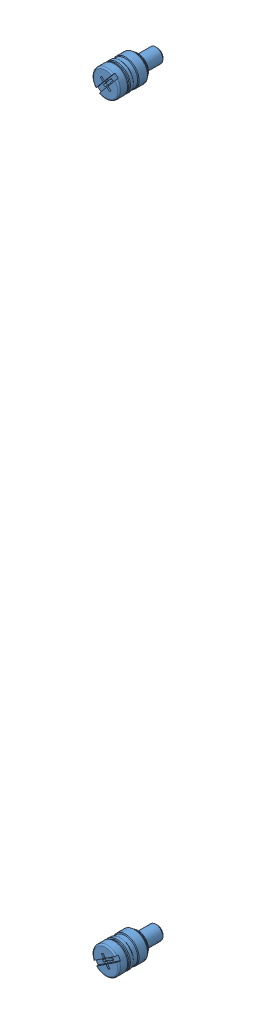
SolidWorks assembly pcb mounting bracket assembly.SLDASM, configuration pcb mounting bracket (file format 5000). Lengths in mm.
Overall size (44.45 238.86 22.45).
3 component instances, 2 part files, 4 mates.
Components (placement in the parent):
- Basic-PCB_Mounting_Bracket-1: Basic-PCB_Mounting_Bracket.SLDPRT [pcb mounting bracket] at origin size (44.45 238.86 13.92)
- captive screw-1: captive screw.SLDPRT [Default] at (0 110.7948 0) x (-0.644751 -0.764392 0) z (0 0 1) size (7.85 7.85 15.11)
- captive screw-2: captive screw.SLDPRT [Default] at (0 -110.7948 0) x (0.834304 0.551305 0) z (0 0 1) size (7.85 7.85 15.11)
Mates (geometry in assembly coordinates):
- Concentric11: concentric anti-aligned: cylinder of Basic-PCB_Mounting_Bracket-1 through (0 -110.7948 -1.2192) axis (0 0 1) radius 3.2004; cylinder of captive screw-2 through (0 -110.7948 -0.1143) axis (0 0 -1) radius 3.5319
- Coincident161: coincident anti-aligned: plane of Basic-PCB_Mounting_Bracket-1 through (-22.225 -119.4308 0) normal (0 0 1); plane of captive screw-2 through (3.0285 -108.7936 0) normal (0 0 -1)
- Concentric2: concentric anti-aligned: cylinder of Basic-PCB_Mounting_Bracket-1 through (0 110.7948 -1.2192) axis (0 0 1) radius 3.2004; cylinder of captive screw-1 through (0 110.7948 -0.1143) axis (0 0 -1) radius 3.5319
- Coincident17: coincident anti-aligned: plane of Basic-PCB_Mounting_Bracket-1 through (-22.225 -119.4308 0) normal (0 0 1); plane of captive screw-1 through (-2.3404 108.0201 0) normal (0 0 -1)
